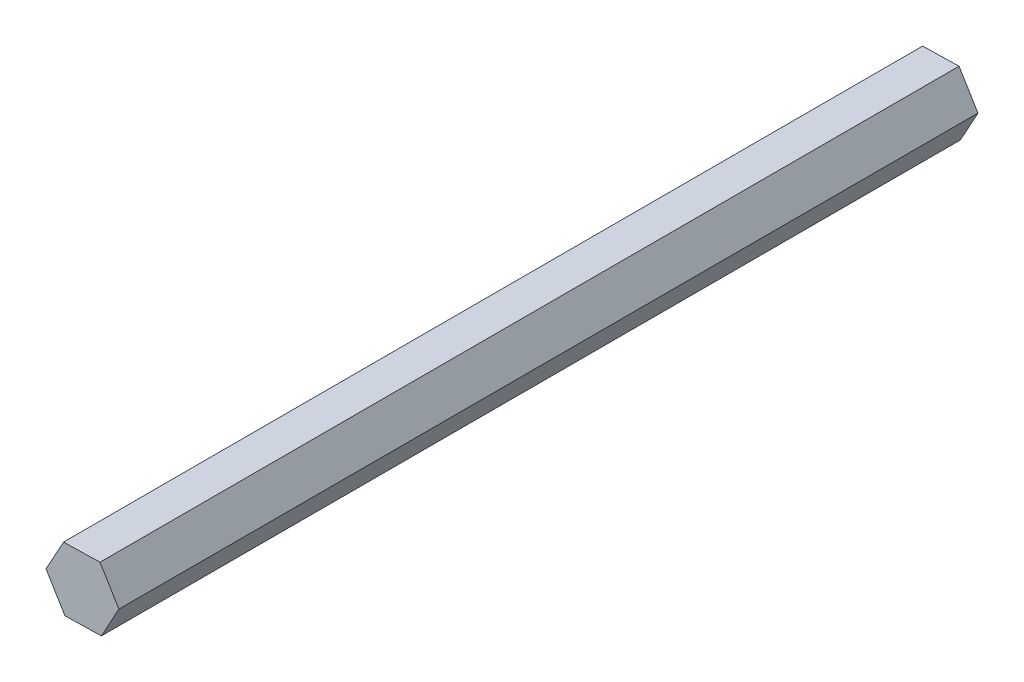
from build123d import *

# Parameters (mm, degrees)
BASE_EXTRUSION_DEPTH = 68


with BuildPart() as part:
    # Esquisse1 → Base-Extrusion (new body)
    with BuildSketch(Plane.XY):
        Polygon((1.498160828, -2.46755901), (2.886049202, 0.063665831), (1.387888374, 2.531224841), (-1.498160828, 2.46755901), (-2.886049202, -0.063665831), (-1.387888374, -2.531224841), align=None)
    extrude(amount=-BASE_EXTRUSION_DEPTH)


solid = part.part
